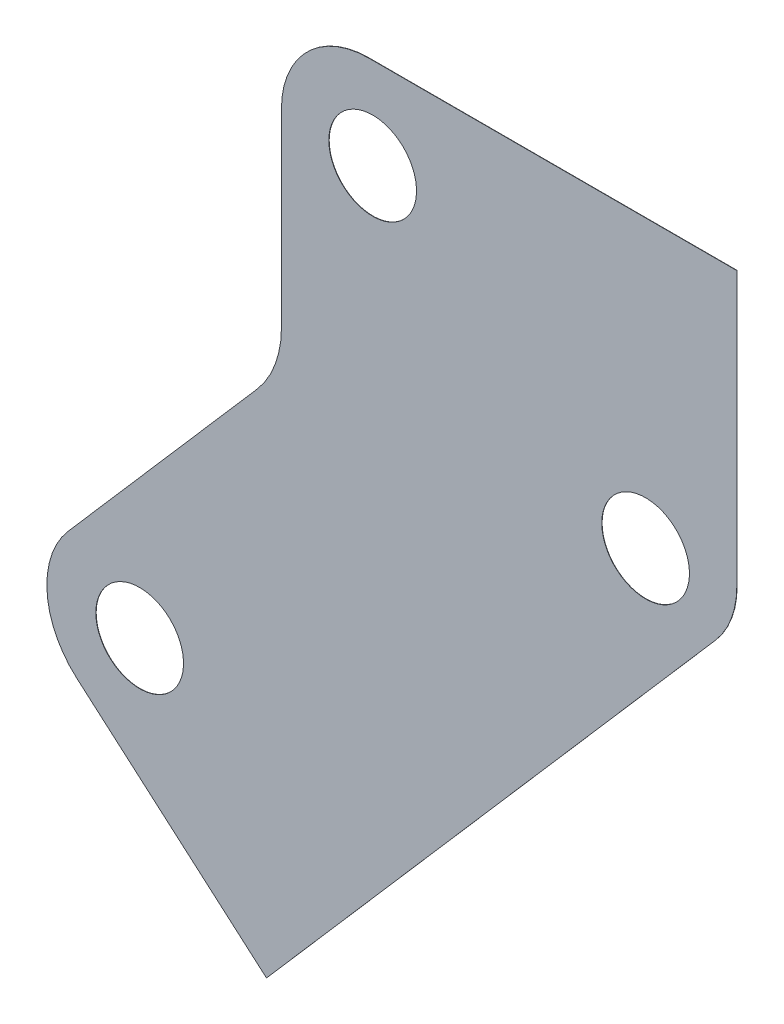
from build123d import *

# Parameters (mm, degrees)
BOSS_EXTRUDE1_DEPTH = 0.0254
HOLE1_D             = 7.1374


with BuildPart() as part:
    # Sketch1 → Boss-Extrude1 (new body)
    with BuildSketch(Plane.XY):
        with BuildLine():
            Line((-702.38556869, -82.752457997), (-665.825225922, -40.653060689))
            ThreePointArc((-665.825225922, -40.653060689), (-664.532779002, -38.478839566), (-664.083, -35.989792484))
            Line((-664.083, -35.989792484), (-664.083, -13.707872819))
            Line((-664.083, -13.707872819), (-694.055, -13.707872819))
            ThreePointArc((-694.055, -13.707872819), (-699.083943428, -15.790929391), (-701.167, -20.819872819))
            Line((-701.167, -20.819872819), (-701.167, -36.282075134))
            ThreePointArc((-701.167, -36.282075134), (-701.681033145, -39.126700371), (-703.158115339, -41.61152451))
            Line((-703.158115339, -41.61152451), (-718.530175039, -59.312519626))
            ThreePointArc((-718.530175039, -59.312519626), (-720.254833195, -64.475362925), (-717.823669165, -69.345561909))
            Line((-717.823669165, -69.345561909), (-702.38556869, -82.752457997))
        make_face()
    extrude(amount=BOSS_EXTRUDE1_DEPTH)

    # Hole1 (through all)
    with Locations(Plane(origin=(-690.083239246, -10.536232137, 0), x_dir=(-1, 0, 0), z_dir=(0, 0, -1))):
        with Locations((3.654260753, -10.601140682), (22.62925804, -53.408015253), (-18.570739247, -26.476140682)):
            Hole(HOLE1_D / 2)


solid = part.part
